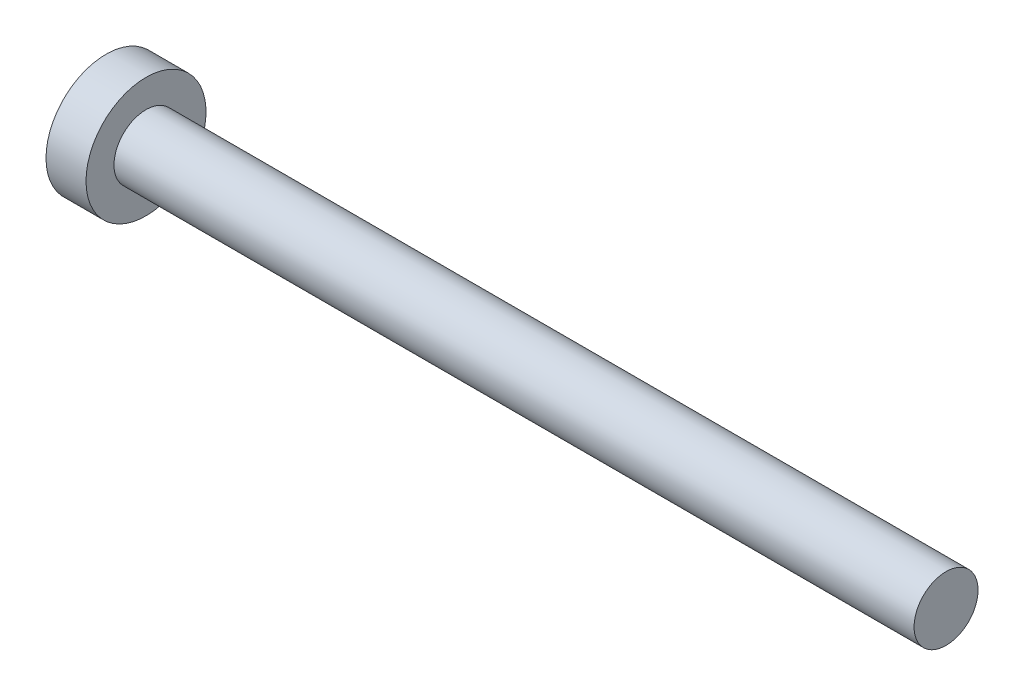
ISO-10303-21;
HEADER;
FILE_DESCRIPTION(('STEP AP214'),'2;1');
FILE_NAME('part.step','',(''),(''),'','','');
FILE_SCHEMA(('AUTOMOTIVE_DESIGN { 1 0 10303 214 1 1 1 1 }'));
ENDSEC;
DATA;
#1=APPLICATION_CONTEXT('core data for automotive mechanical design processes');
#2=APPLICATION_PROTOCOL_DEFINITION('international standard','automotive_design',2000,#1);
#3=PRODUCT_CONTEXT('',#1,'mechanical');
#4=PRODUCT('Part','Part','',(#3));
#5=PRODUCT_RELATED_PRODUCT_CATEGORY('part','',(#4));
#6=PRODUCT_DEFINITION_FORMATION('','',#4);
#7=PRODUCT_DEFINITION_CONTEXT('part definition',#1,'design');
#8=PRODUCT_DEFINITION('design','',#6,#7);
#9=PRODUCT_DEFINITION_SHAPE('','',#8);
#10=(LENGTH_UNIT() NAMED_UNIT(*) SI_UNIT(.MILLI.,.METRE.));
#11=(NAMED_UNIT(*) PLANE_ANGLE_UNIT() SI_UNIT($,.RADIAN.));
#12=(NAMED_UNIT(*) SI_UNIT($,.STERADIAN.) SOLID_ANGLE_UNIT());
#13=UNCERTAINTY_MEASURE_WITH_UNIT(LENGTH_MEASURE(1.E-05),#10,'distance_accuracy_value','');
#14=(GEOMETRIC_REPRESENTATION_CONTEXT(3) GLOBAL_UNCERTAINTY_ASSIGNED_CONTEXT((#13)) GLOBAL_UNIT_ASSIGNED_CONTEXT((#10,
#11,#12)) REPRESENTATION_CONTEXT('',''));
#15=CARTESIAN_POINT('',(0.,0.,0.));
#16=DIRECTION('',(0.,0.,1.));
#17=DIRECTION('',(1.,0.,0.));
#18=AXIS2_PLACEMENT_3D('',#15,#16,#17);
#19=CARTESIAN_POINT('',(-41.8356745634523,0.,0.));
#20=DIRECTION('',(1.,0.,0.));
#21=DIRECTION('',(0.,0.,-1.));
#22=AXIS2_PLACEMENT_3D('',#19,#20,#21);
#23=PLANE('',#22);
#24=CARTESIAN_POINT('',(-41.8356745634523,0.,0.));
#25=DIRECTION('',(-1.,0.,0.));
#26=DIRECTION('',(0.,0.,1.));
#27=AXIS2_PLACEMENT_3D('',#24,#25,#26);
#28=CIRCLE('',#27,15.);
#29=CARTESIAN_POINT('',(-41.8356745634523,0.,15.));
#30=VERTEX_POINT('',#29);
#31=EDGE_CURVE('E10',#30,#30,#28,.T.);
#32=ORIENTED_EDGE('',*,*,#31,.T.);
#33=EDGE_LOOP('',(#32));
#34=FACE_BOUND('',#33,.T.);
#35=ADVANCED_FACE('F29',(#34),#23,.F.);
#36=CARTESIAN_POINT('',(-59.2735791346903,0.,0.));
#37=DIRECTION('',(-1.,0.,0.));
#38=DIRECTION('',(0.,0.,1.));
#39=AXIS2_PLACEMENT_3D('',#36,#37,#38);
#40=CYLINDRICAL_SURFACE('',#39,15.);
#41=ORIENTED_EDGE('',*,*,#31,.F.);
#42=EDGE_LOOP('',(#41));
#43=FACE_BOUND('',#42,.T.);
#44=CARTESIAN_POINT('',(-31.8356745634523,0.,0.));
#45=DIRECTION('',(-1.,0.,0.));
#46=DIRECTION('',(0.,0.,1.));
#47=AXIS2_PLACEMENT_3D('',#44,#45,#46);
#48=CIRCLE('',#47,15.);
#49=CARTESIAN_POINT('',(-31.8356745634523,0.,15.));
#50=VERTEX_POINT('',#49);
#51=EDGE_CURVE('E35',#50,#50,#48,.T.);
#52=ORIENTED_EDGE('',*,*,#51,.T.);
#53=EDGE_LOOP('',(#52));
#54=FACE_BOUND('',#53,.T.);
#55=ADVANCED_FACE('F61',(#43,#54),#40,.T.);
#56=CARTESIAN_POINT('',(-31.8356745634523,15.,0.));
#57=DIRECTION('',(-1.,0.,0.));
#58=DIRECTION('',(0.,0.,1.));
#59=AXIS2_PLACEMENT_3D('',#56,#57,#58);
#60=PLANE('',#59);
#61=ORIENTED_EDGE('',*,*,#51,.F.);
#62=EDGE_LOOP('',(#61));
#63=FACE_BOUND('',#62,.T.);
#64=CARTESIAN_POINT('',(-31.8356745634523,0.,0.));
#65=DIRECTION('',(-1.,0.,0.));
#66=DIRECTION('',(0.,0.,1.));
#67=AXIS2_PLACEMENT_3D('',#64,#65,#66);
#68=CIRCLE('',#67,8.);
#69=CARTESIAN_POINT('',(-31.8356745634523,0.,8.));
#70=VERTEX_POINT('',#69);
#71=EDGE_CURVE('E39',#70,#70,#68,.T.);
#72=ORIENTED_EDGE('',*,*,#71,.T.);
#73=EDGE_LOOP('',(#72));
#74=FACE_BOUND('',#73,.T.);
#75=ADVANCED_FACE('F57',(#63,#74),#60,.F.);
#76=CARTESIAN_POINT('',(-59.2735791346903,0.,0.));
#77=DIRECTION('',(-1.,0.,0.));
#78=DIRECTION('',(0.,0.,1.));
#79=AXIS2_PLACEMENT_3D('',#76,#77,#78);
#80=CYLINDRICAL_SURFACE('',#79,8.);
#81=ORIENTED_EDGE('',*,*,#71,.F.);
#82=EDGE_LOOP('',(#81));
#83=FACE_BOUND('',#82,.T.);
#84=CARTESIAN_POINT('',(168.164325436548,0.,0.));
#85=DIRECTION('',(-1.,0.,0.));
#86=DIRECTION('',(0.,0.,1.));
#87=AXIS2_PLACEMENT_3D('',#84,#85,#86);
#88=CIRCLE('',#87,8.);
#89=CARTESIAN_POINT('',(168.164325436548,0.,8.));
#90=VERTEX_POINT('',#89);
#91=EDGE_CURVE('E43',#90,#90,#88,.T.);
#92=ORIENTED_EDGE('',*,*,#91,.T.);
#93=EDGE_LOOP('',(#92));
#94=FACE_BOUND('',#93,.T.);
#95=ADVANCED_FACE('F49',(#83,#94),#80,.T.);
#96=CARTESIAN_POINT('',(168.164325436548,8.,0.));
#97=DIRECTION('',(-1.,0.,0.));
#98=DIRECTION('',(0.,0.,1.));
#99=AXIS2_PLACEMENT_3D('',#96,#97,#98);
#100=PLANE('',#99);
#101=ORIENTED_EDGE('',*,*,#91,.F.);
#102=EDGE_LOOP('',(#101));
#103=FACE_BOUND('',#102,.T.);
#104=ADVANCED_FACE('F51',(#103),#100,.F.);
#105=CLOSED_SHELL('',(#35,#55,#75,#95,#104));
#106=MANIFOLD_SOLID_BREP('B2',#105);
#107=ADVANCED_BREP_SHAPE_REPRESENTATION('',(#18,#106),#14);
#108=SHAPE_DEFINITION_REPRESENTATION(#9,#107);
ENDSEC;
END-ISO-10303-21;
